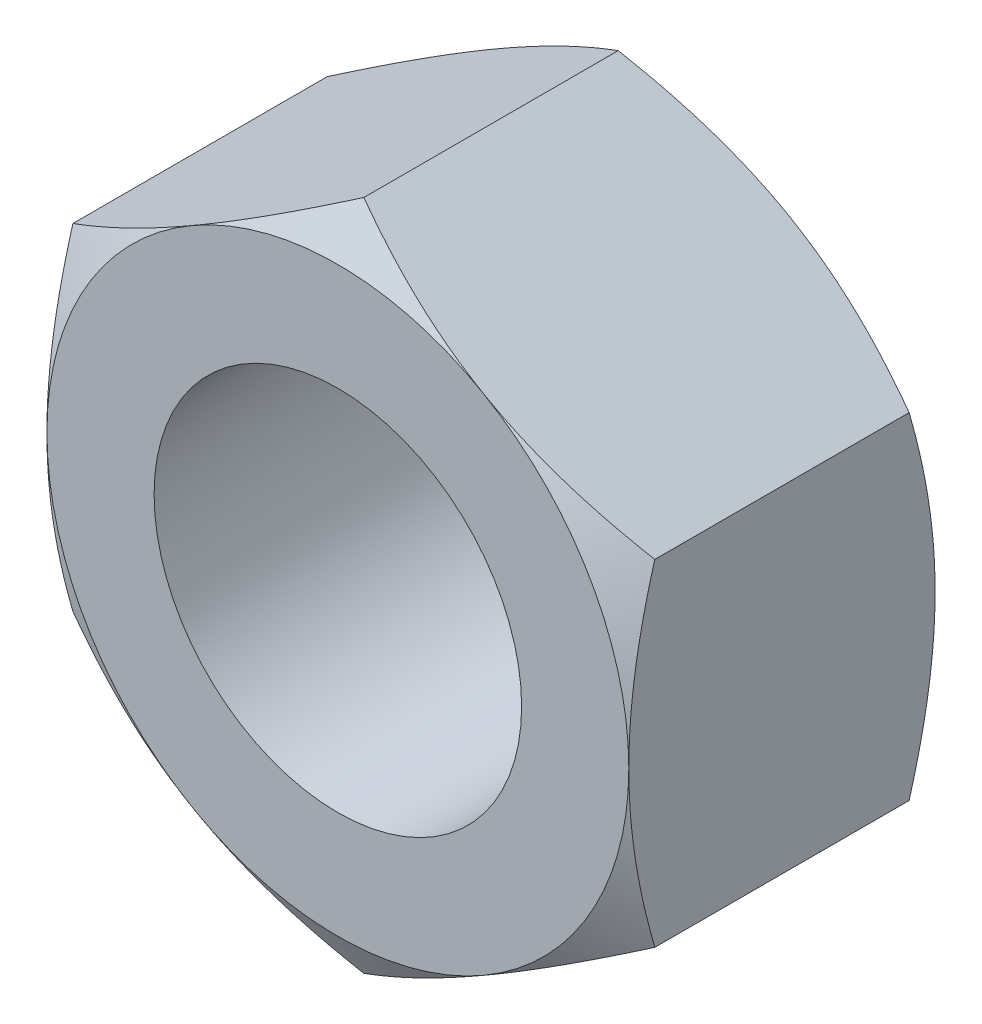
ISO-10303-21;
HEADER;
FILE_DESCRIPTION(('STEP AP214'),'2;1');
FILE_NAME('part.step','',(''),(''),'','','');
FILE_SCHEMA(('AUTOMOTIVE_DESIGN { 1 0 10303 214 1 1 1 1 }'));
ENDSEC;
DATA;
#1=APPLICATION_CONTEXT('core data for automotive mechanical design processes');
#2=APPLICATION_PROTOCOL_DEFINITION('international standard','automotive_design',2000,#1);
#3=PRODUCT_CONTEXT('',#1,'mechanical');
#4=PRODUCT('Part','Part','',(#3));
#5=PRODUCT_RELATED_PRODUCT_CATEGORY('part','',(#4));
#6=PRODUCT_DEFINITION_FORMATION('','',#4);
#7=PRODUCT_DEFINITION_CONTEXT('part definition',#1,'design');
#8=PRODUCT_DEFINITION('design','',#6,#7);
#9=PRODUCT_DEFINITION_SHAPE('','',#8);
#10=(LENGTH_UNIT() NAMED_UNIT(*) SI_UNIT(.MILLI.,.METRE.));
#11=(NAMED_UNIT(*) PLANE_ANGLE_UNIT() SI_UNIT($,.RADIAN.));
#12=(NAMED_UNIT(*) SI_UNIT($,.STERADIAN.) SOLID_ANGLE_UNIT());
#13=UNCERTAINTY_MEASURE_WITH_UNIT(LENGTH_MEASURE(1.E-05),#10,'distance_accuracy_value','');
#14=(GEOMETRIC_REPRESENTATION_CONTEXT(3) GLOBAL_UNCERTAINTY_ASSIGNED_CONTEXT((#13)) GLOBAL_UNIT_ASSIGNED_CONTEXT((#10,
#11,#12)) REPRESENTATION_CONTEXT('',''));
#15=CARTESIAN_POINT('',(0.,0.,0.));
#16=DIRECTION('',(0.,0.,1.));
#17=DIRECTION('',(1.,0.,0.));
#18=AXIS2_PLACEMENT_3D('',#15,#16,#17);
#19=CARTESIAN_POINT('',(0.,0.,10.));
#20=DIRECTION('',(0.,0.,-1.));
#21=DIRECTION('',(0.,-1.,0.));
#22=AXIS2_PLACEMENT_3D('',#19,#20,#21);
#23=CONICAL_SURFACE('',#22,9.5,1.0471975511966);
#24=CARTESIAN_POINT('',(9.5002,5.48471208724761,9.15142755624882));
#25=CARTESIAN_POINT('',(9.2913692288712,5.60528058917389,9.22102656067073));
#26=CARTESIAN_POINT('',(9.08175982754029,5.72629863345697,9.28746669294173));
#27=CARTESIAN_POINT('',(8.66086011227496,5.96930519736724,9.41315271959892));
#28=CARTESIAN_POINT('',(8.44956926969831,6.09129402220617,9.47239624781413));
#29=CARTESIAN_POINT('',(7.81229220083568,6.45922610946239,9.63818542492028));
#30=CARTESIAN_POINT('',(7.38379023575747,6.70662183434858,9.73248555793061));
#31=CARTESIAN_POINT('',(6.74255666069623,7.07683821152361,9.84306129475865));
#32=CARTESIAN_POINT('',(6.53174078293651,7.19855281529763,9.87456017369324));
#33=CARTESIAN_POINT('',(6.10913296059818,7.44254555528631,9.92738179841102));
#34=CARTESIAN_POINT('',(5.89734099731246,7.56482370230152,9.94870434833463));
#35=CARTESIAN_POINT('',(5.47340378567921,7.80958396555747,9.98062697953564));
#36=CARTESIAN_POINT('',(5.26125925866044,7.93206566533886,9.99123980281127));
#37=CARTESIAN_POINT('',(4.83677424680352,8.17714220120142,10.0015174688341));
#38=CARTESIAN_POINT('',(4.62443376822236,8.29973703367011,10.0011826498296));
#39=CARTESIAN_POINT('',(4.22745800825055,8.5289310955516,9.99032663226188));
#40=CARTESIAN_POINT('',(4.04279470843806,8.63554650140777,9.98112973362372));
#41=CARTESIAN_POINT('',(3.67389999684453,8.84852796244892,9.95463460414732));
#42=CARTESIAN_POINT('',(3.48966861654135,8.95489399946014,9.93733580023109));
#43=CARTESIAN_POINT('',(2.937688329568,9.27357996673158,9.87369551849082));
#44=CARTESIAN_POINT('',(2.57091646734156,9.48533580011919,9.81561809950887));
#45=CARTESIAN_POINT('',(1.83348217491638,9.91109368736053,9.67042398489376));
#46=CARTESIAN_POINT('',(1.46291385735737,10.1250414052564,9.58269183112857));
#47=CARTESIAN_POINT('',(0.727303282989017,10.5497463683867,9.38357626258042));
#48=CARTESIAN_POINT('',(0.362251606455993,10.7605090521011,9.27223961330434));
#49=CARTESIAN_POINT('',(-0.000200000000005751,10.9697705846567,9.15142755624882));
#50=B_SPLINE_CURVE_WITH_KNOTS('',3,(#24,#25,#26,#27,#28,#29,#30,#31,#32,#33,#34,#35,#36,#37,#38,
#39,#40,#41,#42,#43,#44,#45,#46,#47,#48,#49),.UNSPECIFIED.,.F.,.F.,(4,2,2,2,2,2,2,2,2,2,2,2,4),
(0.,0.752880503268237,1.50600787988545,3.0154687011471,3.75167336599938,4.48789219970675,
5.22323407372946,5.95855322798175,6.59868084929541,7.23885375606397,8.52010929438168,
9.82978009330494,11.1368800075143),.UNSPECIFIED.);
#51=CARTESIAN_POINT('',(4.75,8.22724133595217,10.));
#52=VERTEX_POINT('',#51);
#53=CARTESIAN_POINT('',(0.,10.9696551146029,9.15149422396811));
#54=VERTEX_POINT('',#53);
#55=EDGE_CURVE('E218',#52,#54,#50,.T.);
#56=ORIENTED_EDGE('',*,*,#55,.T.);
#57=CARTESIAN_POINT('',(0.000200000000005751,10.9697705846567,9.15142755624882));
#58=CARTESIAN_POINT('',(-0.2086307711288,10.8492020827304,9.22102656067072));
#59=CARTESIAN_POINT('',(-0.418240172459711,10.7281840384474,9.28746669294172));
#60=CARTESIAN_POINT('',(-0.83913988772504,10.4851774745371,9.41315271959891));
#61=CARTESIAN_POINT('',(-1.05043073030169,10.3631886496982,9.47239624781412));
#62=CARTESIAN_POINT('',(-1.68770779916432,9.99525656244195,9.63818542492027));
#63=CARTESIAN_POINT('',(-2.11620976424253,9.74786083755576,9.7324855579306));
#64=CARTESIAN_POINT('',(-2.75744333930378,9.37764446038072,9.84306129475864));
#65=CARTESIAN_POINT('',(-2.96825921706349,9.25592985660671,9.87456017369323));
#66=CARTESIAN_POINT('',(-3.39086703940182,9.01193711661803,9.92738179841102));
#67=CARTESIAN_POINT('',(-3.60265900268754,8.88965896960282,9.94870434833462));
#68=CARTESIAN_POINT('',(-4.0265962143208,8.64489870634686,9.98062697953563));
#69=CARTESIAN_POINT('',(-4.23874074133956,8.52241700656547,9.99123980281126));
#70=CARTESIAN_POINT('',(-4.66322575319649,8.27734047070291,10.0015174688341));
#71=CARTESIAN_POINT('',(-4.87556623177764,8.15474563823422,10.0011826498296));
#72=CARTESIAN_POINT('',(-5.27254199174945,7.92555157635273,9.99032663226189));
#73=CARTESIAN_POINT('',(-5.45720529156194,7.81893617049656,9.98112973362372));
#74=CARTESIAN_POINT('',(-5.82610000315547,7.60595470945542,9.95463460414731));
#75=CARTESIAN_POINT('',(-6.01033138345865,7.4995886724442,9.93733580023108));
#76=CARTESIAN_POINT('',(-6.56231167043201,7.18090270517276,9.87369551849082));
#77=CARTESIAN_POINT('',(-6.92908353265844,6.96914687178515,9.81561809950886));
#78=CARTESIAN_POINT('',(-7.66651782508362,6.54338898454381,9.67042398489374));
#79=CARTESIAN_POINT('',(-8.03708614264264,6.32944126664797,9.58269183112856));
#80=CARTESIAN_POINT('',(-8.77269671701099,5.90473630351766,9.38357626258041));
#81=CARTESIAN_POINT('',(-9.13774839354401,5.69397361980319,9.27223961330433));
#82=CARTESIAN_POINT('',(-9.5002,5.4847120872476,9.15142755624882));
#83=B_SPLINE_CURVE_WITH_KNOTS('',3,(#57,#58,#59,#60,#61,#62,#63,#64,#65,#66,#67,#68,#69,#70,#71,
#72,#73,#74,#75,#76,#77,#78,#79,#80,#81,#82),.UNSPECIFIED.,.F.,.F.,(4,2,2,2,2,2,2,2,2,2,2,2,4),
(0.,0.752880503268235,1.50600787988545,3.0154687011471,3.75167336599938,4.48789219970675,
5.22323407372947,5.95855322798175,6.59868084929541,7.23885375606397,8.52010929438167,
9.82978009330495,11.1368800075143),.UNSPECIFIED.);
#84=CARTESIAN_POINT('',(-4.75,8.22724133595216,10.));
#85=VERTEX_POINT('',#84);
#86=EDGE_CURVE('E193',#54,#85,#83,.T.);
#87=ORIENTED_EDGE('',*,*,#86,.T.);
#88=CARTESIAN_POINT('',(0.,0.,10.));
#89=DIRECTION('',(0.,0.,-1.));
#90=DIRECTION('',(0.,-1.,0.));
#91=AXIS2_PLACEMENT_3D('',#88,#89,#90);
#92=CIRCLE('',#91,9.5);
#93=EDGE_CURVE('E22',#85,#52,#92,.T.);
#94=ORIENTED_EDGE('',*,*,#93,.T.);
#95=EDGE_LOOP('',(#56,#87,#94));
#96=FACE_BOUND('',#95,.T.);
#97=ADVANCED_FACE('F14',(#96),#23,.T.);
#98=CARTESIAN_POINT('',(-9.5,0.,10.));
#99=VERTEX_POINT('',#98);
#100=EDGE_CURVE('E9',#99,#85,#92,.T.);
#101=ORIENTED_EDGE('',*,*,#100,.T.);
#102=CARTESIAN_POINT('',(-9.5,5.48482755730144,9.15149422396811));
#103=VERTEX_POINT('',#102);
#104=EDGE_CURVE('E198',#85,#103,#83,.T.);
#105=ORIENTED_EDGE('',*,*,#104,.T.);
#106=CARTESIAN_POINT('',(-9.5,-14.7768881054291,5.34240144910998));
#107=CARTESIAN_POINT('',(-9.5,-14.5692170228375,5.44325410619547));
#108=CARTESIAN_POINT('',(-9.5,-14.3613033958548,5.54360709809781));
#109=CARTESIAN_POINT('',(-9.5,-13.9449404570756,5.74320065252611));
#110=CARTESIAN_POINT('',(-9.5,-13.7364911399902,5.8424412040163));
#111=CARTESIAN_POINT('',(-9.5,-13.1102087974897,6.13835044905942));
#112=CARTESIAN_POINT('',(-9.5,-12.6915021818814,6.33317712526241));
#113=CARTESIAN_POINT('',(-9.5,-11.8490440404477,6.71778749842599));
#114=CARTESIAN_POINT('',(-9.5,-11.4252774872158,6.90753835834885));
#115=CARTESIAN_POINT('',(-9.5,-10.5743892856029,7.27933452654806));
#116=CARTESIAN_POINT('',(-9.5,-10.1472677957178,7.46138019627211));
#117=CARTESIAN_POINT('',(-9.5,-9.2751559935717,7.82143916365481));
#118=CARTESIAN_POINT('',(-9.5,-8.83003331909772,7.99913360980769));
#119=CARTESIAN_POINT('',(-9.5,-7.93459812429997,8.34118035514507));
#120=CARTESIAN_POINT('',(-9.5,-7.48428503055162,8.50553116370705));
#121=CARTESIAN_POINT('',(-9.5,-6.57857515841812,8.81660847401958));
#122=CARTESIAN_POINT('',(-9.5,-6.123190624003,8.96337024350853));
#123=CARTESIAN_POINT('',(-9.5,-5.20590631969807,9.23459172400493));
#124=CARTESIAN_POINT('',(-9.5,-4.74400863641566,9.35905841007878));
#125=CARTESIAN_POINT('',(-9.5,-3.81586790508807,9.57908978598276));
#126=CARTESIAN_POINT('',(-9.5,-3.34966250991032,9.67480903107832));
#127=CARTESIAN_POINT('',(-9.5,-2.64607467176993,9.7926914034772));
#128=CARTESIAN_POINT('',(-9.5,-2.41081552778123,9.82770432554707));
#129=CARTESIAN_POINT('',(-9.5,-1.93911297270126,9.88847905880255));
#130=CARTESIAN_POINT('',(-9.5,-1.70266967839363,9.91424176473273));
#131=CARTESIAN_POINT('',(-9.5,-1.23202577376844,9.95567719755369));
#132=CARTESIAN_POINT('',(-9.5,-0.997836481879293,9.97147797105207));
#133=CARTESIAN_POINT('',(-9.5,-0.528999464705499,9.99315968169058));
#134=CARTESIAN_POINT('',(-9.5,-0.29435174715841,9.99904078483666));
#135=CARTESIAN_POINT('',(-9.5,0.174984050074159,10.0007427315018));
#136=CARTESIAN_POINT('',(-9.5,0.409672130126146,9.99656347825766));
#137=CARTESIAN_POINT('',(-9.5,0.878662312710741,9.97824730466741));
#138=CARTESIAN_POINT('',(-9.5,1.11296439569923,9.96410989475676));
#139=CARTESIAN_POINT('',(-9.5,1.67462761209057,9.91858435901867));
#140=CARTESIAN_POINT('',(-9.5,2.00162031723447,9.88255143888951));
#141=CARTESIAN_POINT('',(-9.5,2.65319317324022,9.7930449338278));
#142=CARTESIAN_POINT('',(-9.5,2.97777299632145,9.73956902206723));
#143=CARTESIAN_POINT('',(-9.5,3.94750507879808,9.55581133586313));
#144=CARTESIAN_POINT('',(-9.5,4.5883017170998,9.40223158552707));
#145=CARTESIAN_POINT('',(-9.5,5.54673517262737,9.13567028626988));
#146=CARTESIAN_POINT('',(-9.5,5.86933349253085,9.03950101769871));
#147=CARTESIAN_POINT('',(-9.5,6.51139619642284,8.83712201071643));
#148=CARTESIAN_POINT('',(-9.5,6.83086055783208,8.73091220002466));
#149=CARTESIAN_POINT('',(-9.5,7.46675774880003,8.51016093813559));
#150=CARTESIAN_POINT('',(-9.5,7.7831915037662,8.39562212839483));
#151=CARTESIAN_POINT('',(-9.5,8.41343066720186,8.15956606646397));
#152=CARTESIAN_POINT('',(-9.5,8.72723612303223,8.03804894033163));
#153=CARTESIAN_POINT('',(-9.5,9.53170935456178,7.71788400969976));
#154=CARTESIAN_POINT('',(-9.5,10.0206671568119,7.51494494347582));
#155=CARTESIAN_POINT('',(-9.5,10.9939165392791,7.09813424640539));
#156=CARTESIAN_POINT('',(-9.5,11.4782077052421,6.88426165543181));
#157=CARTESIAN_POINT('',(-9.5,12.4431215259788,6.44802789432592));
#158=CARTESIAN_POINT('',(-9.5,12.9237429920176,6.22566410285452));
#159=CARTESIAN_POINT('',(-9.5,13.881861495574,5.77436237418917));
#160=CARTESIAN_POINT('',(-9.5,14.3593586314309,5.54542464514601));
#161=CARTESIAN_POINT('',(-9.5,15.3124681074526,5.0820140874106));
#162=CARTESIAN_POINT('',(-9.5,15.7880769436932,4.84753406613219));
#163=CARTESIAN_POINT('',(-9.5,16.7372006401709,4.37437264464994));
#164=CARTESIAN_POINT('',(-9.5,17.2107154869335,4.1356912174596));
#165=CARTESIAN_POINT('',(-9.5,18.1559219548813,3.65495727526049));
#166=CARTESIAN_POINT('',(-9.5,18.6276138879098,3.41290537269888));
#167=CARTESIAN_POINT('',(-9.5,19.5695452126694,2.92599008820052));
#168=CARTESIAN_POINT('',(-9.5,20.0397845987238,2.68112669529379));
#169=CARTESIAN_POINT('',(-9.5,21.3574372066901,1.99084635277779));
#170=CARTESIAN_POINT('',(-9.5,22.2034735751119,1.54280154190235));
#171=CARTESIAN_POINT('',(-9.5,23.892624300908,0.641149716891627));
#172=CARTESIAN_POINT('',(-9.5,24.7357385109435,0.187542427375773));
#173=CARTESIAN_POINT('',(-9.5,26.4172071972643,-0.722510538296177));
#174=CARTESIAN_POINT('',(-9.5,27.255568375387,-1.17894383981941));
#175=CARTESIAN_POINT('',(-9.5,28.5117613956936,-1.86599040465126));
#176=CARTESIAN_POINT('',(-9.5,28.9302537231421,-2.09539769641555));
#177=CARTESIAN_POINT('',(-9.5,29.7668440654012,-2.55492888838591));
#178=CARTESIAN_POINT('',(-9.5,30.1849420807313,-2.78505278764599));
#179=CARTESIAN_POINT('',(-9.5,30.6028664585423,-3.0154916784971));
#180=B_SPLINE_CURVE_WITH_KNOTS('',3,(#106,#107,#108,#109,#110,#111,#112,#113,#114,#115,#116,
#117,#118,#119,#120,#121,#122,#123,#124,#125,#126,#127,#128,#129,#130,#131,#132,#133,#134,#135,
#136,#137,#138,#139,#140,#141,#142,#143,#144,#145,#146,#147,#148,#149,#150,#151,#152,#153,#154,
#155,#156,#157,#158,#159,#160,#161,#162,#163,#164,#165,#166,#167,#168,#169,#170,#171,#172,#173,
#174,#175,#176,#177,#178,#179),.UNSPECIFIED.,.F.,.F.,(4,2,2,2,2,2,2,2,2,2,2,2,2,2,2,2,2,2,2,2,2,
2,2,2,2,2,2,2,2,2,2,2,2,2,2,2,4),(0.,0.692593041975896,1.38519294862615,2.77059563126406,
4.16346471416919,5.55626838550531,6.99394303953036,8.43177807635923,9.86668008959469,
11.301132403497,12.72772860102,13.4411263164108,14.1544550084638,14.8584171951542,
15.5623676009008,16.2663247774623,16.9703165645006,17.956676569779,18.9431682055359,
20.9171958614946,21.9269936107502,22.9367986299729,23.9462847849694,24.9557527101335,
26.5437598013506,28.1319065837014,29.7205476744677,31.309138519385,32.8999184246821,
34.4907085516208,36.0812132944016,37.6717242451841,40.5437464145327,43.415911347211,
46.279575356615,47.711312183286,49.143047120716),.UNSPECIFIED.);
#181=EDGE_CURVE('E183',#103,#99,#180,.F.);
#182=ORIENTED_EDGE('',*,*,#181,.T.);
#183=EDGE_LOOP('',(#101,#105,#182));
#184=FACE_BOUND('',#183,.T.);
#185=ADVANCED_FACE('F304',(#184),#23,.T.);
#186=CARTESIAN_POINT('',(-4.75,-8.22724133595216,10.));
#187=VERTEX_POINT('',#186);
#188=EDGE_CURVE('E23',#187,#99,#92,.T.);
#189=ORIENTED_EDGE('',*,*,#188,.T.);
#190=CARTESIAN_POINT('',(-9.5,-5.48482755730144,9.15149422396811));
#191=VERTEX_POINT('',#190);
#192=EDGE_CURVE('E177',#99,#191,#180,.F.);
#193=ORIENTED_EDGE('',*,*,#192,.T.);
#194=CARTESIAN_POINT('',(-9.5002,-5.4847120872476,9.15142755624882));
#195=CARTESIAN_POINT('',(-9.2913692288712,-5.60528058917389,9.22102656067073));
#196=CARTESIAN_POINT('',(-9.0817598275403,-5.72629863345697,9.28746669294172));
#197=CARTESIAN_POINT('',(-8.66086011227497,-5.96930519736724,9.41315271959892));
#198=CARTESIAN_POINT('',(-8.44956926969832,-6.09129402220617,9.47239624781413));
#199=CARTESIAN_POINT('',(-7.81229220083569,-6.45922610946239,9.63818542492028));
#200=CARTESIAN_POINT('',(-7.38379023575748,-6.70662183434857,9.73248555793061));
#201=CARTESIAN_POINT('',(-6.74255666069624,-7.07683821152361,9.84306129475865));
#202=CARTESIAN_POINT('',(-6.53174078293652,-7.19855281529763,9.87456017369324));
#203=CARTESIAN_POINT('',(-6.10913296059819,-7.4425455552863,9.92738179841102));
#204=CARTESIAN_POINT('',(-5.89734099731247,-7.56482370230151,9.94870434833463));
#205=CARTESIAN_POINT('',(-5.47340378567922,-7.80958396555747,9.98062697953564));
#206=CARTESIAN_POINT('',(-5.26125925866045,-7.93206566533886,9.99123980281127));
#207=CARTESIAN_POINT('',(-4.83677424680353,-8.17714220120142,10.0015174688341));
#208=CARTESIAN_POINT('',(-4.62443376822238,-8.29973703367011,10.0011826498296));
#209=CARTESIAN_POINT('',(-4.22745800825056,-8.5289310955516,9.99032663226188));
#210=CARTESIAN_POINT('',(-4.04279470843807,-8.63554650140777,9.98112973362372));
#211=CARTESIAN_POINT('',(-3.67389999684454,-8.84852796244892,9.95463460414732));
#212=CARTESIAN_POINT('',(-3.48966861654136,-8.95489399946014,9.93733580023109));
#213=CARTESIAN_POINT('',(-2.937688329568,-9.27357996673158,9.87369551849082));
#214=CARTESIAN_POINT('',(-2.57091646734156,-9.48533580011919,9.81561809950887));
#215=CARTESIAN_POINT('',(-1.83348217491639,-9.91109368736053,9.67042398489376));
#216=CARTESIAN_POINT('',(-1.46291385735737,-10.1250414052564,9.58269183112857));
#217=CARTESIAN_POINT('',(-0.727303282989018,-10.5497463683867,9.38357626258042));
#218=CARTESIAN_POINT('',(-0.362251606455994,-10.7605090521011,9.27223961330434));
#219=CARTESIAN_POINT('',(0.000200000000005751,-10.9697705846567,9.15142755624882));
#220=B_SPLINE_CURVE_WITH_KNOTS('',3,(#194,#195,#196,#197,#198,#199,#200,#201,#202,#203,#204,
#205,#206,#207,#208,#209,#210,#211,#212,#213,#214,#215,#216,#217,#218,#219),.UNSPECIFIED.,.F.,
.F.,(4,2,2,2,2,2,2,2,2,2,2,2,4),(0.,0.752880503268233,1.50600787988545,3.01546870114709,
3.75167336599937,4.48789219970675,5.22323407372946,5.95855322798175,6.5986808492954,
7.23885375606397,8.52010929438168,9.82978009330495,11.1368800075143),.UNSPECIFIED.);
#221=EDGE_CURVE('E143',#191,#187,#220,.T.);
#222=ORIENTED_EDGE('',*,*,#221,.T.);
#223=EDGE_LOOP('',(#189,#193,#222));
#224=FACE_BOUND('',#223,.T.);
#225=ADVANCED_FACE('F307',(#224),#23,.T.);
#226=CARTESIAN_POINT('',(9.5,-14.7768881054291,5.34240144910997));
#227=CARTESIAN_POINT('',(9.5,-14.5692170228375,5.44325410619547));
#228=CARTESIAN_POINT('',(9.5,-14.3613033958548,5.54360709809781));
#229=CARTESIAN_POINT('',(9.5,-13.9449404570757,5.74320065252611));
#230=CARTESIAN_POINT('',(9.5,-13.7364911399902,5.8424412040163));
#231=CARTESIAN_POINT('',(9.5,-13.1102087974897,6.13835044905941));
#232=CARTESIAN_POINT('',(9.5,-12.6915021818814,6.3331771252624));
#233=CARTESIAN_POINT('',(9.5,-11.8490440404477,6.71778749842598));
#234=CARTESIAN_POINT('',(9.5,-11.4252774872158,6.90753835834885));
#235=CARTESIAN_POINT('',(9.5,-10.5743892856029,7.27933452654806));
#236=CARTESIAN_POINT('',(9.5,-10.1472677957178,7.46138019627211));
#237=CARTESIAN_POINT('',(9.5,-9.2751559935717,7.82143916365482));
#238=CARTESIAN_POINT('',(9.5,-8.83003331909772,7.9991336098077));
#239=CARTESIAN_POINT('',(9.5,-7.93459812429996,8.34118035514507));
#240=CARTESIAN_POINT('',(9.5,-7.48428503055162,8.50553116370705));
#241=CARTESIAN_POINT('',(9.5,-6.57857515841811,8.81660847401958));
#242=CARTESIAN_POINT('',(9.5,-6.123190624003,8.96337024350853));
#243=CARTESIAN_POINT('',(9.5,-5.20590631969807,9.23459172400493));
#244=CARTESIAN_POINT('',(9.5,-4.74400863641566,9.35905841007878));
#245=CARTESIAN_POINT('',(9.5,-3.81586790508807,9.57908978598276));
#246=CARTESIAN_POINT('',(9.5,-3.34966250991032,9.67480903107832));
#247=CARTESIAN_POINT('',(9.5,-2.64607467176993,9.7926914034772));
#248=CARTESIAN_POINT('',(9.5,-2.41081552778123,9.82770432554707));
#249=CARTESIAN_POINT('',(9.5,-1.93911297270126,9.88847905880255));
#250=CARTESIAN_POINT('',(9.5,-1.70266967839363,9.91424176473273));
#251=CARTESIAN_POINT('',(9.5,-1.23202577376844,9.95567719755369));
#252=CARTESIAN_POINT('',(9.5,-0.997836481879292,9.97147797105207));
#253=CARTESIAN_POINT('',(9.5,-0.528999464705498,9.99315968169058));
#254=CARTESIAN_POINT('',(9.5,-0.294351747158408,9.99904078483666));
#255=CARTESIAN_POINT('',(9.5,0.17498405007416,10.0007427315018));
#256=CARTESIAN_POINT('',(9.5,0.409672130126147,9.99656347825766));
#257=CARTESIAN_POINT('',(9.5,0.878662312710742,9.97824730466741));
#258=CARTESIAN_POINT('',(9.5,1.11296439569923,9.96410989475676));
#259=CARTESIAN_POINT('',(9.5,1.67462761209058,9.91858435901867));
#260=CARTESIAN_POINT('',(9.5,2.00162031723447,9.88255143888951));
#261=CARTESIAN_POINT('',(9.5,2.65319317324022,9.7930449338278));
#262=CARTESIAN_POINT('',(9.5,2.97777299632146,9.73956902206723));
#263=CARTESIAN_POINT('',(9.5,3.94750507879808,9.55581133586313));
#264=CARTESIAN_POINT('',(9.5,4.5883017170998,9.40223158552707));
#265=CARTESIAN_POINT('',(9.5,5.54673517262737,9.13567028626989));
#266=CARTESIAN_POINT('',(9.5,5.86933349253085,9.03950101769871));
#267=CARTESIAN_POINT('',(9.5,6.51139619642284,8.83712201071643));
#268=CARTESIAN_POINT('',(9.5,6.83086055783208,8.73091220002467));
#269=CARTESIAN_POINT('',(9.5,7.46675774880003,8.5101609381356));
#270=CARTESIAN_POINT('',(9.5,7.7831915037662,8.39562212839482));
#271=CARTESIAN_POINT('',(9.5,8.41343066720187,8.15956606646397));
#272=CARTESIAN_POINT('',(9.5,8.72723612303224,8.03804894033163));
#273=CARTESIAN_POINT('',(9.5,9.53170935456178,7.71788400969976));
#274=CARTESIAN_POINT('',(9.5,10.0206671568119,7.51494494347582));
#275=CARTESIAN_POINT('',(9.5,10.9939165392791,7.09813424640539));
#276=CARTESIAN_POINT('',(9.5,11.4782077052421,6.88426165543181));
#277=CARTESIAN_POINT('',(9.5,12.4431215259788,6.44802789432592));
#278=CARTESIAN_POINT('',(9.5,12.9237429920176,6.22566410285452));
#279=CARTESIAN_POINT('',(9.5,13.881861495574,5.77436237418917));
#280=CARTESIAN_POINT('',(9.5,14.3593586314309,5.54542464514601));
#281=CARTESIAN_POINT('',(9.5,15.3124681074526,5.0820140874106));
#282=CARTESIAN_POINT('',(9.5,15.7880769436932,4.84753406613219));
#283=CARTESIAN_POINT('',(9.5,16.7372006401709,4.37437264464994));
#284=CARTESIAN_POINT('',(9.5,17.2107154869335,4.1356912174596));
#285=CARTESIAN_POINT('',(9.5,18.1559219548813,3.65495727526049));
#286=CARTESIAN_POINT('',(9.5,18.6276138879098,3.41290537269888));
#287=CARTESIAN_POINT('',(9.5,19.5695452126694,2.92599008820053));
#288=CARTESIAN_POINT('',(9.5,20.0397845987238,2.6811266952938));
#289=CARTESIAN_POINT('',(9.5,21.3574372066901,1.99084635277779));
#290=CARTESIAN_POINT('',(9.5,22.2034735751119,1.54280154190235));
#291=CARTESIAN_POINT('',(9.5,23.892624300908,0.641149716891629));
#292=CARTESIAN_POINT('',(9.5,24.7357385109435,0.187542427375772));
#293=CARTESIAN_POINT('',(9.5,26.4172071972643,-0.722510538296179));
#294=CARTESIAN_POINT('',(9.5,27.255568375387,-1.17894383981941));
#295=CARTESIAN_POINT('',(9.5,28.5117613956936,-1.86599040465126));
#296=CARTESIAN_POINT('',(9.5,28.9302537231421,-2.09539769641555));
#297=CARTESIAN_POINT('',(9.5,29.7668440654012,-2.55492888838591));
#298=CARTESIAN_POINT('',(9.5,30.1849420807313,-2.78505278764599));
#299=CARTESIAN_POINT('',(9.5,30.6028664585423,-3.0154916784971));
#300=B_SPLINE_CURVE_WITH_KNOTS('',3,(#226,#227,#228,#229,#230,#231,#232,#233,#234,#235,#236,
#237,#238,#239,#240,#241,#242,#243,#244,#245,#246,#247,#248,#249,#250,#251,#252,#253,#254,#255,
#256,#257,#258,#259,#260,#261,#262,#263,#264,#265,#266,#267,#268,#269,#270,#271,#272,#273,#274,
#275,#276,#277,#278,#279,#280,#281,#282,#283,#284,#285,#286,#287,#288,#289,#290,#291,#292,#293,
#294,#295,#296,#297,#298,#299),.UNSPECIFIED.,.F.,.F.,(4,2,2,2,2,2,2,2,2,2,2,2,2,2,2,2,2,2,2,2,2,
2,2,2,2,2,2,2,2,2,2,2,2,2,2,2,4),(0.,0.692593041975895,1.38519294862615,2.77059563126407,
4.16346471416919,5.55626838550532,6.99394303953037,8.43177807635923,9.86668008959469,
11.301132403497,12.72772860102,13.4411263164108,14.1544550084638,14.8584171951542,
15.5623676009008,16.2663247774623,16.9703165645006,17.956676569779,18.9431682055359,
20.9171958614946,21.9269936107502,22.9367986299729,23.9462847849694,24.9557527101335,
26.5437598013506,28.1319065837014,29.7205476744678,31.309138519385,32.8999184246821,
34.4907085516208,36.0812132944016,37.6717242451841,40.5437464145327,43.415911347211,
46.2795753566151,47.711312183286,49.143047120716),.UNSPECIFIED.);
#301=CARTESIAN_POINT('',(9.5,0.,10.));
#302=VERTEX_POINT('',#301);
#303=CARTESIAN_POINT('',(9.5,5.48482755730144,9.15149422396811));
#304=VERTEX_POINT('',#303);
#305=EDGE_CURVE('E256',#302,#304,#300,.T.);
#306=ORIENTED_EDGE('',*,*,#305,.T.);
#307=EDGE_CURVE('E217',#304,#52,#50,.T.);
#308=ORIENTED_EDGE('',*,*,#307,.T.);
#309=EDGE_CURVE('E299',#52,#302,#92,.T.);
#310=ORIENTED_EDGE('',*,*,#309,.T.);
#311=EDGE_LOOP('',(#306,#308,#310));
#312=FACE_BOUND('',#311,.T.);
#313=ADVANCED_FACE('F302',(#312),#23,.T.);
#314=CARTESIAN_POINT('',(4.75,-8.22724133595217,10.));
#315=VERTEX_POINT('',#314);
#316=EDGE_CURVE('E301',#315,#187,#92,.T.);
#317=ORIENTED_EDGE('',*,*,#316,.T.);
#318=CARTESIAN_POINT('',(0.,-10.9696551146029,9.15149422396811));
#319=VERTEX_POINT('',#318);
#320=EDGE_CURVE('E135',#187,#319,#220,.T.);
#321=ORIENTED_EDGE('',*,*,#320,.T.);
#322=CARTESIAN_POINT('',(-0.000200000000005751,-10.9697705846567,9.15142755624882));
#323=CARTESIAN_POINT('',(0.2086307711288,-10.8492020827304,9.22102656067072));
#324=CARTESIAN_POINT('',(0.418240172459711,-10.7281840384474,9.28746669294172));
#325=CARTESIAN_POINT('',(0.839139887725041,-10.4851774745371,9.41315271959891));
#326=CARTESIAN_POINT('',(1.05043073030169,-10.3631886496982,9.47239624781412));
#327=CARTESIAN_POINT('',(1.68770779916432,-9.99525656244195,9.63818542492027));
#328=CARTESIAN_POINT('',(2.11620976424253,-9.74786083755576,9.7324855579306));
#329=CARTESIAN_POINT('',(2.75744333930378,-9.37764446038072,9.84306129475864));
#330=CARTESIAN_POINT('',(2.96825921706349,-9.25592985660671,9.87456017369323));
#331=CARTESIAN_POINT('',(3.39086703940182,-9.01193711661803,9.92738179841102));
#332=CARTESIAN_POINT('',(3.60265900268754,-8.88965896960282,9.94870434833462));
#333=CARTESIAN_POINT('',(4.0265962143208,-8.64489870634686,9.98062697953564));
#334=CARTESIAN_POINT('',(4.23874074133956,-8.52241700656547,9.99123980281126));
#335=CARTESIAN_POINT('',(4.66322575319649,-8.27734047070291,10.0015174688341));
#336=CARTESIAN_POINT('',(4.87556623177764,-8.15474563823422,10.0011826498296));
#337=CARTESIAN_POINT('',(5.27254199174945,-7.92555157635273,9.99032663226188));
#338=CARTESIAN_POINT('',(5.45720529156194,-7.81893617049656,9.98112973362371));
#339=CARTESIAN_POINT('',(5.82610000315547,-7.60595470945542,9.95463460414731));
#340=CARTESIAN_POINT('',(6.01033138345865,-7.4995886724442,9.93733580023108));
#341=CARTESIAN_POINT('',(6.56231167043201,-7.18090270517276,9.87369551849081));
#342=CARTESIAN_POINT('',(6.92908353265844,-6.96914687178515,9.81561809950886));
#343=CARTESIAN_POINT('',(7.66651782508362,-6.54338898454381,9.67042398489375));
#344=CARTESIAN_POINT('',(8.03708614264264,-6.32944126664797,9.58269183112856));
#345=CARTESIAN_POINT('',(8.77269671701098,-5.90473630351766,9.38357626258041));
#346=CARTESIAN_POINT('',(9.13774839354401,-5.6939736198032,9.27223961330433));
#347=CARTESIAN_POINT('',(9.5002,-5.48471208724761,9.15142755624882));
#348=B_SPLINE_CURVE_WITH_KNOTS('',3,(#322,#323,#324,#325,#326,#327,#328,#329,#330,#331,#332,
#333,#334,#335,#336,#337,#338,#339,#340,#341,#342,#343,#344,#345,#346,#347),.UNSPECIFIED.,.F.,
.F.,(4,2,2,2,2,2,2,2,2,2,2,2,4),(0.,0.752880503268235,1.50600787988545,3.0154687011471,
3.75167336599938,4.48789219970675,5.22323407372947,5.95855322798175,6.59868084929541,
7.23885375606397,8.52010929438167,9.82978009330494,11.1368800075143),.UNSPECIFIED.);
#349=EDGE_CURVE('E279',#319,#315,#348,.T.);
#350=ORIENTED_EDGE('',*,*,#349,.T.);
#351=EDGE_LOOP('',(#317,#321,#350));
#352=FACE_BOUND('',#351,.T.);
#353=ADVANCED_FACE('F308',(#352),#23,.T.);
#354=CARTESIAN_POINT('',(0.,0.,10.));
#355=DIRECTION('',(0.,0.,-1.));
#356=DIRECTION('',(0.,-1.,0.));
#357=AXIS2_PLACEMENT_3D('',#354,#355,#356);
#358=PLANE('',#357);
#359=CARTESIAN_POINT('',(0.,0.,10.));
#360=DIRECTION('',(0.,0.,-1.));
#361=DIRECTION('',(0.,-1.,0.));
#362=AXIS2_PLACEMENT_3D('',#359,#360,#361);
#363=CIRCLE('',#362,6.);
#364=CARTESIAN_POINT('',(0.,-6.,10.));
#365=VERTEX_POINT('',#364);
#366=EDGE_CURVE('E311',#365,#365,#363,.T.);
#367=ORIENTED_EDGE('',*,*,#366,.T.);
#368=EDGE_LOOP('',(#367));
#369=FACE_BOUND('',#368,.T.);
#370=ORIENTED_EDGE('',*,*,#100,.F.);
#371=ORIENTED_EDGE('',*,*,#188,.F.);
#372=ORIENTED_EDGE('',*,*,#316,.F.);
#373=EDGE_CURVE('E295',#302,#315,#92,.T.);
#374=ORIENTED_EDGE('',*,*,#373,.F.);
#375=ORIENTED_EDGE('',*,*,#309,.F.);
#376=ORIENTED_EDGE('',*,*,#93,.F.);
#377=EDGE_LOOP('',(#370,#371,#372,#374,#375,#376));
#378=FACE_BOUND('',#377,.T.);
#379=ADVANCED_FACE('F16',(#369,#378),#358,.F.);
#380=CARTESIAN_POINT('',(9.5,-5.48482755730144,9.15149422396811));
#381=VERTEX_POINT('',#380);
#382=EDGE_CURVE('E118',#315,#381,#348,.T.);
#383=ORIENTED_EDGE('',*,*,#382,.T.);
#384=EDGE_CURVE('E255',#381,#302,#300,.T.);
#385=ORIENTED_EDGE('',*,*,#384,.T.);
#386=ORIENTED_EDGE('',*,*,#373,.T.);
#387=EDGE_LOOP('',(#383,#385,#386));
#388=FACE_BOUND('',#387,.T.);
#389=ADVANCED_FACE('F151',(#388),#23,.T.);
#390=CARTESIAN_POINT('',(-9.5,-5.48482755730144,10.));
#391=DIRECTION('',(0.5,0.866025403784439,0.));
#392=DIRECTION('',(-0.866025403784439,0.5,0.));
#393=AXIS2_PLACEMENT_3D('',#390,#391,#392);
#394=PLANE('',#393);
#395=DIRECTION('',(0.,0.,-1.));
#396=VECTOR('',#395,1.);
#397=CARTESIAN_POINT('',(-9.5,-5.48482755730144,10.));
#398=LINE('',#397,#396);
#399=CARTESIAN_POINT('',(-9.5,-5.48482755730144,0.8485057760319));
#400=VERTEX_POINT('',#399);
#401=EDGE_CURVE('E108',#191,#400,#398,.T.);
#402=ORIENTED_EDGE('',*,*,#401,.T.);
#403=CARTESIAN_POINT('',(0.000200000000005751,-10.9697705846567,0.848572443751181));
#404=CARTESIAN_POINT('',(-0.208630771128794,-10.8492020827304,0.778973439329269));
#405=CARTESIAN_POINT('',(-0.418240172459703,-10.7281840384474,0.712533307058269));
#406=CARTESIAN_POINT('',(-0.839139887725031,-10.4851774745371,0.586847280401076));
#407=CARTESIAN_POINT('',(-1.05043073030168,-10.3631886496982,0.527603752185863));
#408=CARTESIAN_POINT('',(-1.68770779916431,-9.99525656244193,0.361814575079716));
#409=CARTESIAN_POINT('',(-2.11620976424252,-9.74786083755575,0.267514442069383));
#410=CARTESIAN_POINT('',(-2.75744333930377,-9.37764446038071,0.156938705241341));
#411=CARTESIAN_POINT('',(-2.96825921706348,-9.25592985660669,0.125439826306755));
#412=CARTESIAN_POINT('',(-3.39086703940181,-9.01193711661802,0.0726182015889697));
#413=CARTESIAN_POINT('',(-3.60265900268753,-8.88965896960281,0.0512956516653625));
#414=CARTESIAN_POINT('',(-4.02659621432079,-8.64489870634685,0.0193730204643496));
#415=CARTESIAN_POINT('',(-4.23874074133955,-8.52241700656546,0.00876019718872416));
#416=CARTESIAN_POINT('',(-4.66322575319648,-8.2773404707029,-0.00151746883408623));
#417=CARTESIAN_POINT('',(-4.87556623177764,-8.15474563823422,-0.00118264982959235));
#418=CARTESIAN_POINT('',(-5.27254199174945,-7.92555157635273,0.00967336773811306));
#419=CARTESIAN_POINT('',(-5.45720529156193,-7.81893617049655,0.0188702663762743));
#420=CARTESIAN_POINT('',(-5.82610000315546,-7.6059547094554,0.0453653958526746));
#421=CARTESIAN_POINT('',(-6.01033138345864,-7.49958867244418,0.0626641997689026));
#422=CARTESIAN_POINT('',(-6.562311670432,-7.18090270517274,0.126304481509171));
#423=CARTESIAN_POINT('',(-6.92908353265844,-6.96914687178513,0.184381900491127));
#424=CARTESIAN_POINT('',(-7.66651782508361,-6.54338898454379,0.329576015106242));
#425=CARTESIAN_POINT('',(-8.03708614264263,-6.32944126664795,0.417308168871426));
#426=CARTESIAN_POINT('',(-8.77269671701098,-5.90473630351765,0.616423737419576));
#427=CARTESIAN_POINT('',(-9.137748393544,-5.69397361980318,0.727760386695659));
#428=CARTESIAN_POINT('',(-9.5002,-5.4847120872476,0.848572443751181));
#429=B_SPLINE_CURVE_WITH_KNOTS('',3,(#403,#404,#405,#406,#407,#408,#409,#410,#411,#412,#413,
#414,#415,#416,#417,#418,#419,#420,#421,#422,#423,#424,#425,#426,#427,#428),.UNSPECIFIED.,.F.,
.F.,(4,2,2,2,2,2,2,2,2,2,2,2,4),(0.,0.752880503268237,1.50600787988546,3.0154687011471,
3.75167336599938,4.48789219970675,5.22323407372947,5.95855322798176,6.59868084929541,
7.23885375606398,8.52010929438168,9.82978009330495,11.1368800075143),.UNSPECIFIED.);
#430=CARTESIAN_POINT('',(-4.75,-8.22724133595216,0.));
#431=VERTEX_POINT('',#430);
#432=EDGE_CURVE('E144',#431,#400,#429,.T.);
#433=ORIENTED_EDGE('',*,*,#432,.F.);
#434=CARTESIAN_POINT('',(0.,-10.9696551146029,0.8485057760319));
#435=VERTEX_POINT('',#434);
#436=EDGE_CURVE('E122',#435,#431,#429,.T.);
#437=ORIENTED_EDGE('',*,*,#436,.F.);
#438=DIRECTION('',(0.,0.,-1.));
#439=VECTOR('',#438,1.);
#440=CARTESIAN_POINT('',(0.,-10.9696551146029,10.));
#441=LINE('',#440,#439);
#442=EDGE_CURVE('E37',#319,#435,#441,.T.);
#443=ORIENTED_EDGE('',*,*,#442,.F.);
#444=ORIENTED_EDGE('',*,*,#320,.F.);
#445=ORIENTED_EDGE('',*,*,#221,.F.);
#446=EDGE_LOOP('',(#402,#433,#437,#443,#444,#445));
#447=FACE_BOUND('',#446,.T.);
#448=ADVANCED_FACE('F153',(#447),#394,.F.);
#449=CARTESIAN_POINT('',(-9.5,5.48482755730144,10.));
#450=DIRECTION('',(1.,0.,0.));
#451=DIRECTION('',(0.,0.,-1.));
#452=AXIS2_PLACEMENT_3D('',#449,#450,#451);
#453=PLANE('',#452);
#454=DIRECTION('',(0.,0.,-1.));
#455=VECTOR('',#454,1.);
#456=CARTESIAN_POINT('',(-9.5,5.48482755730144,10.));
#457=LINE('',#456,#455);
#458=CARTESIAN_POINT('',(-9.5,5.48482755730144,0.8485057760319));
#459=VERTEX_POINT('',#458);
#460=EDGE_CURVE('E323',#103,#459,#457,.T.);
#461=ORIENTED_EDGE('',*,*,#460,.T.);
#462=CARTESIAN_POINT('',(-9.5,-14.7768881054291,4.65759855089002));
#463=CARTESIAN_POINT('',(-9.5,-14.5692170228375,4.55674589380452));
#464=CARTESIAN_POINT('',(-9.5,-14.3613033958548,4.45639290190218));
#465=CARTESIAN_POINT('',(-9.5,-13.9449404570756,4.25679934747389));
#466=CARTESIAN_POINT('',(-9.5,-13.7364911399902,4.15755879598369));
#467=CARTESIAN_POINT('',(-9.5,-13.1102087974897,3.86164955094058));
#468=CARTESIAN_POINT('',(-9.5,-12.6915021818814,3.66682287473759));
#469=CARTESIAN_POINT('',(-9.5,-11.8490440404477,3.28221250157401));
#470=CARTESIAN_POINT('',(-9.5,-11.4252774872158,3.09246164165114));
#471=CARTESIAN_POINT('',(-9.5,-10.5743892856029,2.72066547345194));
#472=CARTESIAN_POINT('',(-9.5,-10.1472677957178,2.53861980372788));
#473=CARTESIAN_POINT('',(-9.5,-9.2751559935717,2.17856083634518));
#474=CARTESIAN_POINT('',(-9.5,-8.83003331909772,2.0008663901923));
#475=CARTESIAN_POINT('',(-9.5,-7.93459812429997,1.65881964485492));
#476=CARTESIAN_POINT('',(-9.5,-7.48428503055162,1.49446883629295));
#477=CARTESIAN_POINT('',(-9.5,-6.57857515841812,1.18339152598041));
#478=CARTESIAN_POINT('',(-9.5,-6.123190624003,1.03662975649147));
#479=CARTESIAN_POINT('',(-9.5,-5.20590631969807,0.765408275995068));
#480=CARTESIAN_POINT('',(-9.5,-4.74400863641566,0.640941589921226));
#481=CARTESIAN_POINT('',(-9.5,-3.81586790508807,0.420910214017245));
#482=CARTESIAN_POINT('',(-9.5,-3.34966250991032,0.325190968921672));
#483=CARTESIAN_POINT('',(-9.5,-2.64607467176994,0.207308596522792));
#484=CARTESIAN_POINT('',(-9.5,-2.41081552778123,0.172295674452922));
#485=CARTESIAN_POINT('',(-9.5,-1.93911297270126,0.111520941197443));
#486=CARTESIAN_POINT('',(-9.5,-1.70266967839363,0.0857582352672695));
#487=CARTESIAN_POINT('',(-9.5,-1.23202577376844,0.0443228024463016));
#488=CARTESIAN_POINT('',(-9.5,-0.997836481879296,0.0285220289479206));
#489=CARTESIAN_POINT('',(-9.5,-0.528999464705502,0.00684031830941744));
#490=CARTESIAN_POINT('',(-9.5,-0.294351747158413,0.000959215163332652));
#491=CARTESIAN_POINT('',(-9.5,0.174984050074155,-0.000742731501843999));
#492=CARTESIAN_POINT('',(-9.5,0.409672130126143,0.00343652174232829));
#493=CARTESIAN_POINT('',(-9.5,0.878662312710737,0.0217526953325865));
#494=CARTESIAN_POINT('',(-9.5,1.11296439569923,0.0358901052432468));
#495=CARTESIAN_POINT('',(-9.5,1.67462761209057,0.081415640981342));
#496=CARTESIAN_POINT('',(-9.5,2.00162031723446,0.117448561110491));
#497=CARTESIAN_POINT('',(-9.5,2.65319317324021,0.206955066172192));
#498=CARTESIAN_POINT('',(-9.5,2.97777299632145,0.260430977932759));
#499=CARTESIAN_POINT('',(-9.5,3.94750507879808,0.444188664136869));
#500=CARTESIAN_POINT('',(-9.5,4.5883017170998,0.597768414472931));
#501=CARTESIAN_POINT('',(-9.5,5.54673517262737,0.86432971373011));
#502=CARTESIAN_POINT('',(-9.5,5.86933349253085,0.960498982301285));
#503=CARTESIAN_POINT('',(-9.5,6.51139619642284,1.16287798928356));
#504=CARTESIAN_POINT('',(-9.5,6.83086055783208,1.26908779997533));
#505=CARTESIAN_POINT('',(-9.5,7.46675774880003,1.4898390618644));
#506=CARTESIAN_POINT('',(-9.5,7.78319150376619,1.60437787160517));
#507=CARTESIAN_POINT('',(-9.5,8.41343066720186,1.84043393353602));
#508=CARTESIAN_POINT('',(-9.5,8.72723612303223,1.96195105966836));
#509=CARTESIAN_POINT('',(-9.5,9.53170935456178,2.28211599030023));
#510=CARTESIAN_POINT('',(-9.5,10.0206671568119,2.48505505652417));
#511=CARTESIAN_POINT('',(-9.5,10.9939165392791,2.90186575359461));
#512=CARTESIAN_POINT('',(-9.5,11.4782077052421,3.11573834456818));
#513=CARTESIAN_POINT('',(-9.5,12.4431215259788,3.55197210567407));
#514=CARTESIAN_POINT('',(-9.5,12.9237429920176,3.77433589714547));
#515=CARTESIAN_POINT('',(-9.5,13.881861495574,4.22563762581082));
#516=CARTESIAN_POINT('',(-9.5,14.3593586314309,4.45457535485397));
#517=CARTESIAN_POINT('',(-9.5,15.3124681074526,4.91798591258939));
#518=CARTESIAN_POINT('',(-9.5,15.7880769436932,5.1524659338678));
#519=CARTESIAN_POINT('',(-9.5,16.7372006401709,5.62562735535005));
#520=CARTESIAN_POINT('',(-9.5,17.2107154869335,5.86430878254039));
#521=CARTESIAN_POINT('',(-9.5,18.1559219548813,6.3450427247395));
#522=CARTESIAN_POINT('',(-9.5,18.6276138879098,6.58709462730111));
#523=CARTESIAN_POINT('',(-9.5,19.5695452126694,7.07400991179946));
#524=CARTESIAN_POINT('',(-9.5,20.0397845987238,7.31887330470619));
#525=CARTESIAN_POINT('',(-9.5,21.35743720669,8.00915364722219));
#526=CARTESIAN_POINT('',(-9.5,22.2034735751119,8.45719845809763));
#527=CARTESIAN_POINT('',(-9.5,23.8926243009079,9.35885028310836));
#528=CARTESIAN_POINT('',(-9.5,24.7357385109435,9.81245757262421));
#529=CARTESIAN_POINT('',(-9.5,26.4172071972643,10.7225105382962));
#530=CARTESIAN_POINT('',(-9.5,27.255568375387,11.1789438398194));
#531=CARTESIAN_POINT('',(-9.5,28.5117613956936,11.8659904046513));
#532=CARTESIAN_POINT('',(-9.5,28.9302537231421,12.0953976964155));
#533=CARTESIAN_POINT('',(-9.5,29.7668440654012,12.5549288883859));
#534=CARTESIAN_POINT('',(-9.5,30.1849420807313,12.785052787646));
#535=CARTESIAN_POINT('',(-9.5,30.6028664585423,13.0154916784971));
#536=B_SPLINE_CURVE_WITH_KNOTS('',3,(#462,#463,#464,#465,#466,#467,#468,#469,#470,#471,#472,
#473,#474,#475,#476,#477,#478,#479,#480,#481,#482,#483,#484,#485,#486,#487,#488,#489,#490,#491,
#492,#493,#494,#495,#496,#497,#498,#499,#500,#501,#502,#503,#504,#505,#506,#507,#508,#509,#510,
#511,#512,#513,#514,#515,#516,#517,#518,#519,#520,#521,#522,#523,#524,#525,#526,#527,#528,#529,
#530,#531,#532,#533,#534,#535),.UNSPECIFIED.,.F.,.F.,(4,2,2,2,2,2,2,2,2,2,2,2,2,2,2,2,2,2,2,2,2,
2,2,2,2,2,2,2,2,2,2,2,2,2,2,2,4),(0.,0.692593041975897,1.38519294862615,2.77059563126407,
4.1634647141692,5.55626838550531,6.99394303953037,8.43177807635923,9.86668008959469,
11.301132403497,12.72772860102,13.4411263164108,14.1544550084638,14.8584171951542,
15.5623676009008,16.2663247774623,16.9703165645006,17.956676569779,18.9431682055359,
20.9171958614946,21.9269936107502,22.9367986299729,23.9462847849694,24.9557527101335,
26.5437598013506,28.1319065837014,29.7205476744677,31.309138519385,32.8999184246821,
34.4907085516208,36.0812132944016,37.6717242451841,40.5437464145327,43.415911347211,
46.279575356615,47.711312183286,49.143047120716),.UNSPECIFIED.);
#537=CARTESIAN_POINT('',(-9.5,0.,0.));
#538=VERTEX_POINT('',#537);
#539=EDGE_CURVE('E171',#538,#459,#536,.T.);
#540=ORIENTED_EDGE('',*,*,#539,.F.);
#541=EDGE_CURVE('E184',#400,#538,#536,.T.);
#542=ORIENTED_EDGE('',*,*,#541,.F.);
#543=ORIENTED_EDGE('',*,*,#401,.F.);
#544=ORIENTED_EDGE('',*,*,#192,.F.);
#545=ORIENTED_EDGE('',*,*,#181,.F.);
#546=EDGE_LOOP('',(#461,#540,#542,#543,#544,#545));
#547=FACE_BOUND('',#546,.T.);
#548=ADVANCED_FACE('F158',(#547),#453,.F.);
#549=CARTESIAN_POINT('',(0.,10.9696551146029,10.));
#550=DIRECTION('',(0.5,-0.866025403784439,0.));
#551=DIRECTION('',(0.866025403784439,0.5,0.));
#552=AXIS2_PLACEMENT_3D('',#549,#550,#551);
#553=PLANE('',#552);
#554=DIRECTION('',(0.,0.,-1.));
#555=VECTOR('',#554,1.);
#556=CARTESIAN_POINT('',(0.,10.9696551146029,10.));
#557=LINE('',#556,#555);
#558=CARTESIAN_POINT('',(0.,10.9696551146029,0.8485057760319));
#559=VERTEX_POINT('',#558);
#560=EDGE_CURVE('E320',#54,#559,#557,.T.);
#561=ORIENTED_EDGE('',*,*,#560,.T.);
#562=CARTESIAN_POINT('',(-9.5002,5.4847120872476,0.848572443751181));
#563=CARTESIAN_POINT('',(-9.29136922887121,5.6052805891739,0.778973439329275));
#564=CARTESIAN_POINT('',(-9.0817598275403,5.72629863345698,0.712533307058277));
#565=CARTESIAN_POINT('',(-8.66086011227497,5.96930519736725,0.586847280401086));
#566=CARTESIAN_POINT('',(-8.44956926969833,6.09129402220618,0.527603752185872));
#567=CARTESIAN_POINT('',(-7.81229220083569,6.4592261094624,0.361814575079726));
#568=CARTESIAN_POINT('',(-7.38379023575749,6.70662183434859,0.267514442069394));
#569=CARTESIAN_POINT('',(-6.74255666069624,7.07683821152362,0.156938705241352));
#570=CARTESIAN_POINT('',(-6.53174078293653,7.19855281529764,0.125439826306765));
#571=CARTESIAN_POINT('',(-6.1091329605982,7.44254555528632,0.0726182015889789));
#572=CARTESIAN_POINT('',(-5.89734099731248,7.56482370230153,0.0512956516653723));
#573=CARTESIAN_POINT('',(-5.47340378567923,7.80958396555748,0.0193730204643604));
#574=CARTESIAN_POINT('',(-5.26125925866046,7.93206566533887,0.00876019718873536));
#575=CARTESIAN_POINT('',(-4.83677424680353,8.17714220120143,-0.00151746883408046));
#576=CARTESIAN_POINT('',(-4.62443376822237,8.29973703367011,-0.00118264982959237));
#577=CARTESIAN_POINT('',(-4.22745800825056,8.5289310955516,0.00967336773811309));
#578=CARTESIAN_POINT('',(-4.04279470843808,8.63554650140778,0.0188702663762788));
#579=CARTESIAN_POINT('',(-3.67389999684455,8.84852796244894,0.0453653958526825));
#580=CARTESIAN_POINT('',(-3.48966861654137,8.95489399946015,0.0626641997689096));
#581=CARTESIAN_POINT('',(-2.93768832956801,9.27357996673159,0.126304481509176));
#582=CARTESIAN_POINT('',(-2.57091646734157,9.4853358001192,0.184381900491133));
#583=CARTESIAN_POINT('',(-1.8334821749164,9.91109368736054,0.329576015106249));
#584=CARTESIAN_POINT('',(-1.46291385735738,10.1250414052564,0.417308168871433));
#585=CARTESIAN_POINT('',(-0.727303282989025,10.5497463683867,0.616423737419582));
#586=CARTESIAN_POINT('',(-0.362251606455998,10.7605090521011,0.727760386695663));
#587=CARTESIAN_POINT('',(0.000200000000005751,10.9697705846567,0.848572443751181));
#588=B_SPLINE_CURVE_WITH_KNOTS('',3,(#562,#563,#564,#565,#566,#567,#568,#569,#570,#571,#572,
#573,#574,#575,#576,#577,#578,#579,#580,#581,#582,#583,#584,#585,#586,#587),.UNSPECIFIED.,.F.,
.F.,(4,2,2,2,2,2,2,2,2,2,2,2,4),(0.,0.752880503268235,1.50600787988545,3.0154687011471,
3.75167336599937,4.48789219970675,5.22323407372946,5.95855322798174,6.5986808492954,
7.23885375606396,8.52010929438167,9.82978009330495,11.1368800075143),.UNSPECIFIED.);
#589=CARTESIAN_POINT('',(-4.75,8.22724133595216,0.));
#590=VERTEX_POINT('',#589);
#591=EDGE_CURVE('E210',#590,#559,#588,.T.);
#592=ORIENTED_EDGE('',*,*,#591,.F.);
#593=EDGE_CURVE('E204',#459,#590,#588,.T.);
#594=ORIENTED_EDGE('',*,*,#593,.F.);
#595=ORIENTED_EDGE('',*,*,#460,.F.);
#596=ORIENTED_EDGE('',*,*,#104,.F.);
#597=ORIENTED_EDGE('',*,*,#86,.F.);
#598=EDGE_LOOP('',(#561,#592,#594,#595,#596,#597));
#599=FACE_BOUND('',#598,.T.);
#600=ADVANCED_FACE('F165',(#599),#553,.F.);
#601=CARTESIAN_POINT('',(9.5,5.48482755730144,10.));
#602=DIRECTION('',(-0.5,-0.866025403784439,0.));
#603=DIRECTION('',(0.866025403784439,-0.5,0.));
#604=AXIS2_PLACEMENT_3D('',#601,#602,#603);
#605=PLANE('',#604);
#606=DIRECTION('',(0.,0.,-1.));
#607=VECTOR('',#606,1.);
#608=CARTESIAN_POINT('',(9.5,5.48482755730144,10.));
#609=LINE('',#608,#607);
#610=CARTESIAN_POINT('',(9.5,5.48482755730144,0.8485057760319));
#611=VERTEX_POINT('',#610);
#612=EDGE_CURVE('E312',#304,#611,#609,.T.);
#613=ORIENTED_EDGE('',*,*,#612,.T.);
#614=CARTESIAN_POINT('',(-0.000200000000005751,10.9697705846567,0.848572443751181));
#615=CARTESIAN_POINT('',(0.208630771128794,10.8492020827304,0.778973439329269));
#616=CARTESIAN_POINT('',(0.418240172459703,10.7281840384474,0.712533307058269));
#617=CARTESIAN_POINT('',(0.839139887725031,10.4851774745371,0.586847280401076));
#618=CARTESIAN_POINT('',(1.05043073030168,10.3631886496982,0.527603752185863));
#619=CARTESIAN_POINT('',(1.68770779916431,9.99525656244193,0.361814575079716));
#620=CARTESIAN_POINT('',(2.11620976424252,9.74786083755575,0.267514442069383));
#621=CARTESIAN_POINT('',(2.75744333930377,9.37764446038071,0.156938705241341));
#622=CARTESIAN_POINT('',(2.96825921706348,9.25592985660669,0.125439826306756));
#623=CARTESIAN_POINT('',(3.39086703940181,9.01193711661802,0.07261820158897));
#624=CARTESIAN_POINT('',(3.60265900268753,8.88965896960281,0.0512956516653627));
#625=CARTESIAN_POINT('',(4.02659621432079,8.64489870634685,0.0193730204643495));
#626=CARTESIAN_POINT('',(4.23874074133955,8.52241700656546,0.00876019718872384));
#627=CARTESIAN_POINT('',(4.66322575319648,8.2773404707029,-0.00151746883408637));
#628=CARTESIAN_POINT('',(4.87556623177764,8.15474563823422,-0.0011826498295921));
#629=CARTESIAN_POINT('',(5.27254199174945,7.92555157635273,0.00967336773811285));
#630=CARTESIAN_POINT('',(5.45720529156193,7.81893617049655,0.0188702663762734));
#631=CARTESIAN_POINT('',(5.82610000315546,7.6059547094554,0.0453653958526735));
#632=CARTESIAN_POINT('',(6.01033138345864,7.49958867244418,0.0626641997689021));
#633=CARTESIAN_POINT('',(6.562311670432,7.18090270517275,0.126304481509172));
#634=CARTESIAN_POINT('',(6.92908353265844,6.96914687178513,0.184381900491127));
#635=CARTESIAN_POINT('',(7.66651782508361,6.5433889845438,0.329576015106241));
#636=CARTESIAN_POINT('',(8.03708614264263,6.32944126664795,0.417308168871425));
#637=CARTESIAN_POINT('',(8.77269671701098,5.90473630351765,0.616423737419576));
#638=CARTESIAN_POINT('',(9.137748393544,5.69397361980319,0.727760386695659));
#639=CARTESIAN_POINT('',(9.5002,5.48471208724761,0.848572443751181));
#640=B_SPLINE_CURVE_WITH_KNOTS('',3,(#614,#615,#616,#617,#618,#619,#620,#621,#622,#623,#624,
#625,#626,#627,#628,#629,#630,#631,#632,#633,#634,#635,#636,#637,#638,#639),.UNSPECIFIED.,.F.,
.F.,(4,2,2,2,2,2,2,2,2,2,2,2,4),(0.,0.752880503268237,1.50600787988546,3.0154687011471,
3.75167336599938,4.48789219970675,5.22323407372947,5.95855322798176,6.59868084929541,
7.23885375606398,8.52010929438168,9.82978009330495,11.1368800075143),.UNSPECIFIED.);
#641=CARTESIAN_POINT('',(4.75,8.22724133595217,0.));
#642=VERTEX_POINT('',#641);
#643=EDGE_CURVE('E248',#642,#611,#640,.T.);
#644=ORIENTED_EDGE('',*,*,#643,.F.);
#645=EDGE_CURVE('E254',#559,#642,#640,.T.);
#646=ORIENTED_EDGE('',*,*,#645,.F.);
#647=ORIENTED_EDGE('',*,*,#560,.F.);
#648=ORIENTED_EDGE('',*,*,#55,.F.);
#649=ORIENTED_EDGE('',*,*,#307,.F.);
#650=EDGE_LOOP('',(#613,#644,#646,#647,#648,#649));
#651=FACE_BOUND('',#650,.T.);
#652=ADVANCED_FACE('F261',(#651),#605,.F.);
#653=CARTESIAN_POINT('',(9.5,-5.48482755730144,10.));
#654=DIRECTION('',(-1.,0.,0.));
#655=DIRECTION('',(0.,0.,1.));
#656=AXIS2_PLACEMENT_3D('',#653,#654,#655);
#657=PLANE('',#656);
#658=DIRECTION('',(0.,0.,-1.));
#659=VECTOR('',#658,1.);
#660=CARTESIAN_POINT('',(9.5,-5.48482755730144,10.));
#661=LINE('',#660,#659);
#662=CARTESIAN_POINT('',(9.5,-5.48482755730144,0.8485057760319));
#663=VERTEX_POINT('',#662);
#664=EDGE_CURVE('E30',#381,#663,#661,.T.);
#665=ORIENTED_EDGE('',*,*,#664,.T.);
#666=CARTESIAN_POINT('',(9.5,-14.7768881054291,4.65759855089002));
#667=CARTESIAN_POINT('',(9.5,-14.5692170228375,4.55674589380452));
#668=CARTESIAN_POINT('',(9.5,-14.3613033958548,4.45639290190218));
#669=CARTESIAN_POINT('',(9.5,-13.9449404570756,4.25679934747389));
#670=CARTESIAN_POINT('',(9.5,-13.7364911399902,4.15755879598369));
#671=CARTESIAN_POINT('',(9.5,-13.1102087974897,3.86164955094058));
#672=CARTESIAN_POINT('',(9.5,-12.6915021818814,3.66682287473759));
#673=CARTESIAN_POINT('',(9.5,-11.8490440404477,3.28221250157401));
#674=CARTESIAN_POINT('',(9.5,-11.4252774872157,3.09246164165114));
#675=CARTESIAN_POINT('',(9.5,-10.5743892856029,2.72066547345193));
#676=CARTESIAN_POINT('',(9.5,-10.1472677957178,2.53861980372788));
#677=CARTESIAN_POINT('',(9.5,-9.2751559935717,2.17856083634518));
#678=CARTESIAN_POINT('',(9.5,-8.83003331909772,2.0008663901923));
#679=CARTESIAN_POINT('',(9.5,-7.93459812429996,1.65881964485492));
#680=CARTESIAN_POINT('',(9.5,-7.48428503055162,1.49446883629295));
#681=CARTESIAN_POINT('',(9.5,-6.57857515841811,1.18339152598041));
#682=CARTESIAN_POINT('',(9.5,-6.123190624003,1.03662975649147));
#683=CARTESIAN_POINT('',(9.5,-5.20590631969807,0.765408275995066));
#684=CARTESIAN_POINT('',(9.5,-4.74400863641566,0.640941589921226));
#685=CARTESIAN_POINT('',(9.5,-3.81586790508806,0.420910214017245));
#686=CARTESIAN_POINT('',(9.5,-3.34966250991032,0.325190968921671));
#687=CARTESIAN_POINT('',(9.5,-2.64607467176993,0.207308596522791));
#688=CARTESIAN_POINT('',(9.5,-2.41081552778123,0.172295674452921));
#689=CARTESIAN_POINT('',(9.5,-1.93911297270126,0.111520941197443));
#690=CARTESIAN_POINT('',(9.5,-1.70266967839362,0.0857582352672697));
#691=CARTESIAN_POINT('',(9.5,-1.23202577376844,0.0443228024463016));
#692=CARTESIAN_POINT('',(9.5,-0.997836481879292,0.0285220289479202));
#693=CARTESIAN_POINT('',(9.5,-0.528999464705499,0.00684031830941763));
#694=CARTESIAN_POINT('',(9.5,-0.294351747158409,0.000959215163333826));
#695=CARTESIAN_POINT('',(9.5,0.174984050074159,-0.000742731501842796));
#696=CARTESIAN_POINT('',(9.5,0.409672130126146,0.00343652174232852));
#697=CARTESIAN_POINT('',(9.5,0.878662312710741,0.021752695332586));
#698=CARTESIAN_POINT('',(9.5,1.11296439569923,0.0358901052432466));
#699=CARTESIAN_POINT('',(9.5,1.67462761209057,0.0814156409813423));
#700=CARTESIAN_POINT('',(9.5,2.00162031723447,0.117448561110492));
#701=CARTESIAN_POINT('',(9.5,2.65319317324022,0.206955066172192));
#702=CARTESIAN_POINT('',(9.5,2.97777299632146,0.260430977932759));
#703=CARTESIAN_POINT('',(9.5,3.94750507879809,0.44418866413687));
#704=CARTESIAN_POINT('',(9.5,4.58830171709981,0.597768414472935));
#705=CARTESIAN_POINT('',(9.5,5.54673517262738,0.864329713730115));
#706=CARTESIAN_POINT('',(9.5,5.86933349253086,0.96049898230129));
#707=CARTESIAN_POINT('',(9.5,6.51139619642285,1.16287798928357));
#708=CARTESIAN_POINT('',(9.5,6.83086055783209,1.26908779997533));
#709=CARTESIAN_POINT('',(9.5,7.46675774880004,1.4898390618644));
#710=CARTESIAN_POINT('',(9.5,7.78319150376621,1.60437787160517));
#711=CARTESIAN_POINT('',(9.5,8.41343066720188,1.84043393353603));
#712=CARTESIAN_POINT('',(9.5,8.72723612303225,1.96195105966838));
#713=CARTESIAN_POINT('',(9.5,9.53170935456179,2.28211599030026));
#714=CARTESIAN_POINT('',(9.5,10.020667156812,2.48505505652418));
#715=CARTESIAN_POINT('',(9.5,10.9939165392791,2.90186575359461));
#716=CARTESIAN_POINT('',(9.5,11.4782077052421,3.11573834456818));
#717=CARTESIAN_POINT('',(9.5,12.4431215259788,3.55197210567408));
#718=CARTESIAN_POINT('',(9.5,12.9237429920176,3.77433589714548));
#719=CARTESIAN_POINT('',(9.5,13.881861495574,4.22563762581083));
#720=CARTESIAN_POINT('',(9.5,14.3593586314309,4.45457535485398));
#721=CARTESIAN_POINT('',(9.5,15.3124681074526,4.91798591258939));
#722=CARTESIAN_POINT('',(9.5,15.7880769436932,5.15246593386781));
#723=CARTESIAN_POINT('',(9.5,16.7372006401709,5.62562735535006));
#724=CARTESIAN_POINT('',(9.5,17.2107154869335,5.8643087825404));
#725=CARTESIAN_POINT('',(9.5,18.1559219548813,6.34504272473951));
#726=CARTESIAN_POINT('',(9.5,18.6276138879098,6.58709462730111));
#727=CARTESIAN_POINT('',(9.5,19.5695452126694,7.07400991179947));
#728=CARTESIAN_POINT('',(9.5,20.0397845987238,7.31887330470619));
#729=CARTESIAN_POINT('',(9.5,21.3574372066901,8.0091536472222));
#730=CARTESIAN_POINT('',(9.5,22.2034735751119,8.45719845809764));
#731=CARTESIAN_POINT('',(9.5,23.892624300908,9.35885028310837));
#732=CARTESIAN_POINT('',(9.5,24.7357385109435,9.81245757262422));
#733=CARTESIAN_POINT('',(9.5,26.4172071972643,10.7225105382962));
#734=CARTESIAN_POINT('',(9.5,27.255568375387,11.1789438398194));
#735=CARTESIAN_POINT('',(9.5,28.5117613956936,11.8659904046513));
#736=CARTESIAN_POINT('',(9.5,28.9302537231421,12.0953976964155));
#737=CARTESIAN_POINT('',(9.5,29.7668440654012,12.5549288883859));
#738=CARTESIAN_POINT('',(9.5,30.1849420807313,12.785052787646));
#739=CARTESIAN_POINT('',(9.5,30.6028664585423,13.0154916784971));
#740=B_SPLINE_CURVE_WITH_KNOTS('',3,(#666,#667,#668,#669,#670,#671,#672,#673,#674,#675,#676,
#677,#678,#679,#680,#681,#682,#683,#684,#685,#686,#687,#688,#689,#690,#691,#692,#693,#694,#695,
#696,#697,#698,#699,#700,#701,#702,#703,#704,#705,#706,#707,#708,#709,#710,#711,#712,#713,#714,
#715,#716,#717,#718,#719,#720,#721,#722,#723,#724,#725,#726,#727,#728,#729,#730,#731,#732,#733,
#734,#735,#736,#737,#738,#739),.UNSPECIFIED.,.F.,.F.,(4,2,2,2,2,2,2,2,2,2,2,2,2,2,2,2,2,2,2,2,2,
2,2,2,2,2,2,2,2,2,2,2,2,2,2,2,4),(0.,0.692593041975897,1.38519294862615,2.77059563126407,
4.1634647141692,5.55626838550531,6.99394303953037,8.43177807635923,9.8666800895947,
11.301132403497,12.72772860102,13.4411263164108,14.1544550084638,14.8584171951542,
15.5623676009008,16.2663247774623,16.9703165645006,17.956676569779,18.9431682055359,
20.9171958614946,21.9269936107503,22.9367986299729,23.9462847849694,24.9557527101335,
26.5437598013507,28.1319065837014,29.7205476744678,31.309138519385,32.8999184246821,
34.4907085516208,36.0812132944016,37.6717242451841,40.5437464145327,43.415911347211,
46.2795753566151,47.711312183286,49.143047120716),.UNSPECIFIED.);
#741=CARTESIAN_POINT('',(9.5,0.,0.));
#742=VERTEX_POINT('',#741);
#743=EDGE_CURVE('E117',#742,#663,#740,.F.);
#744=ORIENTED_EDGE('',*,*,#743,.F.);
#745=EDGE_CURVE('E287',#611,#742,#740,.F.);
#746=ORIENTED_EDGE('',*,*,#745,.F.);
#747=ORIENTED_EDGE('',*,*,#612,.F.);
#748=ORIENTED_EDGE('',*,*,#305,.F.);
#749=ORIENTED_EDGE('',*,*,#384,.F.);
#750=EDGE_LOOP('',(#665,#744,#746,#747,#748,#749));
#751=FACE_BOUND('',#750,.T.);
#752=ADVANCED_FACE('F264',(#751),#657,.F.);
#753=CARTESIAN_POINT('',(0.,-10.9696551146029,10.));
#754=DIRECTION('',(-0.5,0.866025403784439,0.));
#755=DIRECTION('',(-0.866025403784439,-0.5,0.));
#756=AXIS2_PLACEMENT_3D('',#753,#754,#755);
#757=PLANE('',#756);
#758=ORIENTED_EDGE('',*,*,#442,.T.);
#759=CARTESIAN_POINT('',(9.5002,-5.48471208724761,0.848572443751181));
#760=CARTESIAN_POINT('',(9.2913692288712,-5.6052805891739,0.778973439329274));
#761=CARTESIAN_POINT('',(9.0817598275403,-5.72629863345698,0.712533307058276));
#762=CARTESIAN_POINT('',(8.66086011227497,-5.96930519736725,0.586847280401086));
#763=CARTESIAN_POINT('',(8.44956926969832,-6.09129402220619,0.527603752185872));
#764=CARTESIAN_POINT('',(7.81229220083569,-6.4592261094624,0.361814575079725));
#765=CARTESIAN_POINT('',(7.38379023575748,-6.70662183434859,0.267514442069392));
#766=CARTESIAN_POINT('',(6.74255666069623,-7.07683821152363,0.156938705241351));
#767=CARTESIAN_POINT('',(6.53174078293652,-7.19855281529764,0.125439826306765));
#768=CARTESIAN_POINT('',(6.10913296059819,-7.44254555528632,0.0726182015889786));
#769=CARTESIAN_POINT('',(5.89734099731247,-7.56482370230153,0.0512956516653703));
#770=CARTESIAN_POINT('',(5.47340378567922,-7.80958396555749,0.0193730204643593));
#771=CARTESIAN_POINT('',(5.26125925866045,-7.93206566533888,0.00876019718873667));
#772=CARTESIAN_POINT('',(4.83677424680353,-8.17714220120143,-0.00151746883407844));
#773=CARTESIAN_POINT('',(4.62443376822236,-8.29973703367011,-0.0011826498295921));
#774=CARTESIAN_POINT('',(4.22745800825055,-8.5289310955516,0.00967336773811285));
#775=CARTESIAN_POINT('',(4.04279470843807,-8.63554650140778,0.0188702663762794));
#776=CARTESIAN_POINT('',(3.67389999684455,-8.84852796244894,0.0453653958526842));
#777=CARTESIAN_POINT('',(3.48966861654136,-8.95489399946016,0.0626641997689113));
#778=CARTESIAN_POINT('',(2.937688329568,-9.27357996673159,0.126304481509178));
#779=CARTESIAN_POINT('',(2.57091646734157,-9.4853358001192,0.184381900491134));
#780=CARTESIAN_POINT('',(1.83348217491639,-9.91109368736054,0.329576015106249));
#781=CARTESIAN_POINT('',(1.46291385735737,-10.1250414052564,0.417308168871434));
#782=CARTESIAN_POINT('',(0.727303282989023,-10.5497463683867,0.616423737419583));
#783=CARTESIAN_POINT('',(0.362251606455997,-10.7605090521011,0.727760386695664));
#784=CARTESIAN_POINT('',(-0.000200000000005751,-10.9697705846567,0.848572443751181));
#785=B_SPLINE_CURVE_WITH_KNOTS('',3,(#759,#760,#761,#762,#763,#764,#765,#766,#767,#768,#769,
#770,#771,#772,#773,#774,#775,#776,#777,#778,#779,#780,#781,#782,#783,#784),.UNSPECIFIED.,.F.,
.F.,(4,2,2,2,2,2,2,2,2,2,2,2,4),(0.,0.752880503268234,1.50600787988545,3.0154687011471,
3.75167336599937,4.48789219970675,5.22323407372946,5.95855322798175,6.59868084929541,
7.23885375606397,8.52010929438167,9.82978009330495,11.1368800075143),.UNSPECIFIED.);
#786=CARTESIAN_POINT('',(4.75,-8.22724133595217,0.));
#787=VERTEX_POINT('',#786);
#788=EDGE_CURVE('E101',#787,#435,#785,.T.);
#789=ORIENTED_EDGE('',*,*,#788,.F.);
#790=EDGE_CURVE('E104',#663,#787,#785,.T.);
#791=ORIENTED_EDGE('',*,*,#790,.F.);
#792=ORIENTED_EDGE('',*,*,#664,.F.);
#793=ORIENTED_EDGE('',*,*,#382,.F.);
#794=ORIENTED_EDGE('',*,*,#349,.F.);
#795=EDGE_LOOP('',(#758,#789,#791,#792,#793,#794));
#796=FACE_BOUND('',#795,.T.);
#797=ADVANCED_FACE('F103',(#796),#757,.F.);
#798=CARTESIAN_POINT('',(0.,0.,5.));
#799=DIRECTION('',(0.,0.,1.));
#800=DIRECTION('',(0.,1.,0.));
#801=AXIS2_PLACEMENT_3D('',#798,#799,#800);
#802=CONICAL_SURFACE('',#801,18.1602540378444,1.0471975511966);
#803=CARTESIAN_POINT('',(0.,0.,0.));
#804=DIRECTION('',(0.,0.,-1.));
#805=DIRECTION('',(0.,-1.,0.));
#806=AXIS2_PLACEMENT_3D('',#803,#804,#805);
#807=CIRCLE('',#806,9.5);
#808=EDGE_CURVE('E126',#431,#538,#807,.T.);
#809=ORIENTED_EDGE('',*,*,#808,.F.);
#810=ORIENTED_EDGE('',*,*,#432,.T.);
#811=ORIENTED_EDGE('',*,*,#541,.T.);
#812=EDGE_LOOP('',(#809,#810,#811));
#813=FACE_BOUND('',#812,.T.);
#814=ADVANCED_FACE('F228',(#813),#802,.T.);
#815=EDGE_CURVE('E115',#742,#787,#807,.T.);
#816=ORIENTED_EDGE('',*,*,#815,.F.);
#817=ORIENTED_EDGE('',*,*,#743,.T.);
#818=ORIENTED_EDGE('',*,*,#790,.T.);
#819=EDGE_LOOP('',(#816,#817,#818));
#820=FACE_BOUND('',#819,.T.);
#821=ADVANCED_FACE('F113',(#820),#802,.T.);
#822=EDGE_CURVE('E130',#642,#742,#807,.T.);
#823=ORIENTED_EDGE('',*,*,#822,.F.);
#824=ORIENTED_EDGE('',*,*,#643,.T.);
#825=ORIENTED_EDGE('',*,*,#745,.T.);
#826=EDGE_LOOP('',(#823,#824,#825));
#827=FACE_BOUND('',#826,.T.);
#828=ADVANCED_FACE('F227',(#827),#802,.T.);
#829=EDGE_CURVE('E131',#590,#642,#807,.T.);
#830=ORIENTED_EDGE('',*,*,#829,.F.);
#831=ORIENTED_EDGE('',*,*,#591,.T.);
#832=ORIENTED_EDGE('',*,*,#645,.T.);
#833=EDGE_LOOP('',(#830,#831,#832));
#834=FACE_BOUND('',#833,.T.);
#835=ADVANCED_FACE('F456',(#834),#802,.T.);
#836=EDGE_CURVE('E132',#538,#590,#807,.T.);
#837=ORIENTED_EDGE('',*,*,#836,.F.);
#838=ORIENTED_EDGE('',*,*,#539,.T.);
#839=ORIENTED_EDGE('',*,*,#593,.T.);
#840=EDGE_LOOP('',(#837,#838,#839));
#841=FACE_BOUND('',#840,.T.);
#842=ADVANCED_FACE('F450',(#841),#802,.T.);
#843=CARTESIAN_POINT('',(-9.5,0.,0.));
#844=DIRECTION('',(0.,0.,1.));
#845=DIRECTION('',(0.,1.,0.));
#846=AXIS2_PLACEMENT_3D('',#843,#844,#845);
#847=PLANE('',#846);
#848=CARTESIAN_POINT('',(0.,0.,0.));
#849=DIRECTION('',(0.,0.,1.));
#850=DIRECTION('',(0.,1.,0.));
#851=AXIS2_PLACEMENT_3D('',#848,#849,#850);
#852=CIRCLE('',#851,6.);
#853=CARTESIAN_POINT('',(0.,6.,0.));
#854=VERTEX_POINT('',#853);
#855=EDGE_CURVE('E315',#854,#854,#852,.T.);
#856=ORIENTED_EDGE('',*,*,#855,.T.);
#857=EDGE_LOOP('',(#856));
#858=FACE_BOUND('',#857,.T.);
#859=ORIENTED_EDGE('',*,*,#808,.T.);
#860=ORIENTED_EDGE('',*,*,#836,.T.);
#861=ORIENTED_EDGE('',*,*,#829,.T.);
#862=ORIENTED_EDGE('',*,*,#822,.T.);
#863=ORIENTED_EDGE('',*,*,#815,.T.);
#864=EDGE_CURVE('E120',#787,#431,#807,.T.);
#865=ORIENTED_EDGE('',*,*,#864,.T.);
#866=EDGE_LOOP('',(#859,#860,#861,#862,#863,#865));
#867=FACE_BOUND('',#866,.T.);
#868=ADVANCED_FACE('F127',(#858,#867),#847,.F.);
#869=ORIENTED_EDGE('',*,*,#788,.T.);
#870=ORIENTED_EDGE('',*,*,#436,.T.);
#871=ORIENTED_EDGE('',*,*,#864,.F.);
#872=EDGE_LOOP('',(#869,#870,#871));
#873=FACE_BOUND('',#872,.T.);
#874=ADVANCED_FACE('F121',(#873),#802,.T.);
#875=CARTESIAN_POINT('',(0.,0.,45.));
#876=DIRECTION('',(0.,0.,-1.));
#877=DIRECTION('',(0.,-1.,0.));
#878=AXIS2_PLACEMENT_3D('',#875,#876,#877);
#879=CYLINDRICAL_SURFACE('',#878,6.);
#880=ORIENTED_EDGE('',*,*,#855,.F.);
#881=EDGE_LOOP('',(#880));
#882=FACE_BOUND('',#881,.T.);
#883=ORIENTED_EDGE('',*,*,#366,.F.);
#884=EDGE_LOOP('',(#883));
#885=FACE_BOUND('',#884,.T.);
#886=ADVANCED_FACE('F160',(#882,#885),#879,.F.);
#887=CLOSED_SHELL('',(#97,#185,#225,#313,#353,#379,#389,#448,#548,#600,#652,#752,#797,#814,#821,
#828,#835,#842,#868,#874,#886));
#888=MANIFOLD_SOLID_BREP('B1',#887);
#889=ADVANCED_BREP_SHAPE_REPRESENTATION('',(#18,#888),#14);
#890=SHAPE_DEFINITION_REPRESENTATION(#9,#889);
ENDSEC;
END-ISO-10303-21;
